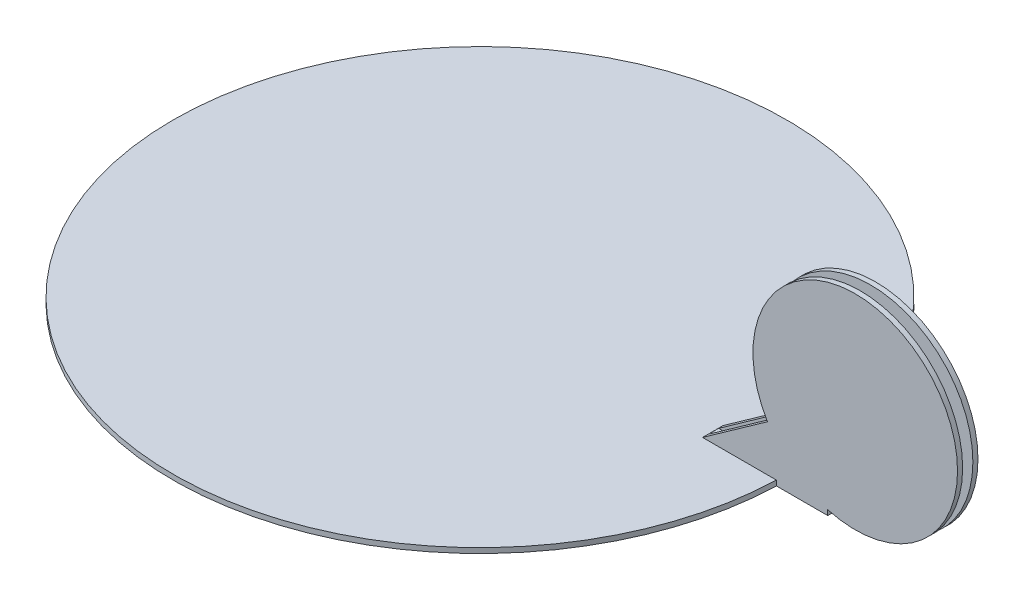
ISO-10303-21;
HEADER;
FILE_DESCRIPTION(('STEP AP214'),'2;1');
FILE_NAME('part.step','',(''),(''),'','','');
FILE_SCHEMA(('AUTOMOTIVE_DESIGN { 1 0 10303 214 1 1 1 1 }'));
ENDSEC;
DATA;
#1=APPLICATION_CONTEXT('core data for automotive mechanical design processes');
#2=APPLICATION_PROTOCOL_DEFINITION('international standard','automotive_design',2000,#1);
#3=PRODUCT_CONTEXT('',#1,'mechanical');
#4=PRODUCT('Part','Part','',(#3));
#5=PRODUCT_RELATED_PRODUCT_CATEGORY('part','',(#4));
#6=PRODUCT_DEFINITION_FORMATION('','',#4);
#7=PRODUCT_DEFINITION_CONTEXT('part definition',#1,'design');
#8=PRODUCT_DEFINITION('design','',#6,#7);
#9=PRODUCT_DEFINITION_SHAPE('','',#8);
#10=(LENGTH_UNIT() NAMED_UNIT(*) SI_UNIT(.MILLI.,.METRE.));
#11=(NAMED_UNIT(*) PLANE_ANGLE_UNIT() SI_UNIT($,.RADIAN.));
#12=(NAMED_UNIT(*) SI_UNIT($,.STERADIAN.) SOLID_ANGLE_UNIT());
#13=UNCERTAINTY_MEASURE_WITH_UNIT(LENGTH_MEASURE(1.E-05),#10,'distance_accuracy_value','');
#14=(GEOMETRIC_REPRESENTATION_CONTEXT(3) GLOBAL_UNCERTAINTY_ASSIGNED_CONTEXT((#13)) GLOBAL_UNIT_ASSIGNED_CONTEXT((#10,
#11,#12)) REPRESENTATION_CONTEXT('',''));
#15=CARTESIAN_POINT('',(0.,0.,0.));
#16=DIRECTION('',(0.,0.,1.));
#17=DIRECTION('',(1.,0.,0.));
#18=AXIS2_PLACEMENT_3D('',#15,#16,#17);
#19=CARTESIAN_POINT('',(95.7307074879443,25.7342889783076,-2.54));
#20=DIRECTION('',(0.,0.,1.));
#21=DIRECTION('',(1.,0.,0.));
#22=AXIS2_PLACEMENT_3D('',#19,#20,#21);
#23=CYLINDRICAL_SURFACE('',#22,25.4);
#24=DIRECTION('',(0.,0.,1.));
#25=VECTOR('',#24,1.);
#26=CARTESIAN_POINT('',(73.9300811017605,12.7,-2.54));
#27=LINE('',#26,#25);
#28=CARTESIAN_POINT('',(73.9300811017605,12.7,-2.54));
#29=VERTEX_POINT('',#28);
#30=CARTESIAN_POINT('',(73.9300811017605,12.7,-1.26999999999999));
#31=VERTEX_POINT('',#30);
#32=EDGE_CURVE('E187',#29,#31,#27,.T.);
#33=ORIENTED_EDGE('',*,*,#32,.T.);
#34=CARTESIAN_POINT('',(95.7307074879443,25.7342889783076,-1.27));
#35=DIRECTION('',(0.,0.,1.));
#36=DIRECTION('',(1.,0.,0.));
#37=AXIS2_PLACEMENT_3D('',#34,#35,#36);
#38=CIRCLE('',#37,25.4);
#39=CARTESIAN_POINT('',(88.9,1.27000000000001,-1.27));
#40=VERTEX_POINT('',#39);
#41=EDGE_CURVE('E152',#40,#31,#38,.T.);
#42=ORIENTED_EDGE('',*,*,#41,.F.);
#43=DIRECTION('',(0.,0.,1.));
#44=VECTOR('',#43,1.);
#45=CARTESIAN_POINT('',(88.9,1.27000000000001,-2.54));
#46=LINE('',#45,#44);
#47=CARTESIAN_POINT('',(88.9,1.27000000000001,-2.54));
#48=VERTEX_POINT('',#47);
#49=EDGE_CURVE('E183',#48,#40,#46,.T.);
#50=ORIENTED_EDGE('',*,*,#49,.F.);
#51=CARTESIAN_POINT('',(95.7307074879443,25.7342889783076,-2.54));
#52=DIRECTION('',(0.,0.,-1.));
#53=DIRECTION('',(-1.,0.,0.));
#54=AXIS2_PLACEMENT_3D('',#51,#52,#53);
#55=CIRCLE('',#54,25.4);
#56=EDGE_CURVE('E169',#29,#48,#55,.T.);
#57=ORIENTED_EDGE('',*,*,#56,.F.);
#58=EDGE_LOOP('',(#33,#42,#50,#57));
#59=FACE_BOUND('',#58,.T.);
#60=ADVANCED_FACE('F32',(#59),#23,.T.);
#61=CARTESIAN_POINT('',(0.,0.,0.));
#62=DIRECTION('',(0.,1.,0.));
#63=DIRECTION('',(0.,0.,1.));
#64=AXIS2_PLACEMENT_3D('',#61,#62,#63);
#65=PLANE('',#64);
#66=DIRECTION('',(-1.,0.,0.));
#67=VECTOR('',#66,1.);
#68=CARTESIAN_POINT('',(125.702464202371,0.,-1.27));
#69=LINE('',#68,#67);
#70=CARTESIAN_POINT('',(88.9,0.,-1.27));
#71=VERTEX_POINT('',#70);
#72=CARTESIAN_POINT('',(76.93459056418,0.,-1.26999999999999));
#73=VERTEX_POINT('',#72);
#74=EDGE_CURVE('E229',#71,#73,#69,.T.);
#75=ORIENTED_EDGE('',*,*,#74,.T.);
#76=DIRECTION('',(0.,0.,1.));
#77=VECTOR('',#76,1.);
#78=CARTESIAN_POINT('',(76.93459056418,0.,-1.26999999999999));
#79=LINE('',#78,#77);
#80=CARTESIAN_POINT('',(76.93459056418,0.,1.27000000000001));
#81=VERTEX_POINT('',#80);
#82=EDGE_CURVE('E147',#73,#81,#79,.T.);
#83=ORIENTED_EDGE('',*,*,#82,.T.);
#84=DIRECTION('',(1.,0.,0.));
#85=VECTOR('',#84,1.);
#86=CARTESIAN_POINT('',(125.702464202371,0.,1.27));
#87=LINE('',#86,#85);
#88=CARTESIAN_POINT('',(88.9,0.,1.27));
#89=VERTEX_POINT('',#88);
#90=EDGE_CURVE('E143',#81,#89,#87,.T.);
#91=ORIENTED_EDGE('',*,*,#90,.T.);
#92=DIRECTION('',(0.,0.,1.));
#93=VECTOR('',#92,1.);
#94=CARTESIAN_POINT('',(88.9,0.,-2.54));
#95=LINE('',#94,#93);
#96=CARTESIAN_POINT('',(88.9,0.,2.54));
#97=VERTEX_POINT('',#96);
#98=EDGE_CURVE('E178',#89,#97,#95,.T.);
#99=ORIENTED_EDGE('',*,*,#98,.T.);
#100=DIRECTION('',(1.,0.,0.));
#101=VECTOR('',#100,1.);
#102=CARTESIAN_POINT('',(76.2,0.,2.54));
#103=LINE('',#102,#101);
#104=CARTESIAN_POINT('',(76.1576549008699,0.,2.54));
#105=VERTEX_POINT('',#104);
#106=EDGE_CURVE('E161',#105,#97,#103,.T.);
#107=ORIENTED_EDGE('',*,*,#106,.F.);
#108=CARTESIAN_POINT('',(0.,0.,0.));
#109=DIRECTION('',(0.,1.,0.));
#110=DIRECTION('',(0.,0.,1.));
#111=AXIS2_PLACEMENT_3D('',#108,#109,#110);
#112=CIRCLE('',#111,76.2);
#113=CARTESIAN_POINT('',(76.1576549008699,0.,-2.54));
#114=VERTEX_POINT('',#113);
#115=EDGE_CURVE('E197',#114,#105,#112,.T.);
#116=ORIENTED_EDGE('',*,*,#115,.F.);
#117=DIRECTION('',(1.,0.,0.));
#118=VECTOR('',#117,1.);
#119=CARTESIAN_POINT('',(76.2,0.,-2.54));
#120=LINE('',#119,#118);
#121=CARTESIAN_POINT('',(88.9,0.,-2.54));
#122=VERTEX_POINT('',#121);
#123=EDGE_CURVE('E174',#114,#122,#120,.T.);
#124=ORIENTED_EDGE('',*,*,#123,.T.);
#125=EDGE_CURVE('E179',#122,#71,#95,.T.);
#126=ORIENTED_EDGE('',*,*,#125,.T.);
#127=EDGE_LOOP('',(#75,#83,#91,#99,#107,#116,#124,#126));
#128=FACE_BOUND('',#127,.T.);
#129=ADVANCED_FACE('F227',(#128),#65,.F.);
#130=CARTESIAN_POINT('',(95.7307074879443,25.7342889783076,1.27));
#131=DIRECTION('',(0.,0.,-1.));
#132=DIRECTION('',(-1.,0.,0.));
#133=AXIS2_PLACEMENT_3D('',#130,#131,#132);
#134=CIRCLE('',#133,25.4);
#135=CARTESIAN_POINT('',(73.9300811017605,12.7,1.26999999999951));
#136=VERTEX_POINT('',#135);
#137=CARTESIAN_POINT('',(88.9,1.27000000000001,1.27));
#138=VERTEX_POINT('',#137);
#139=EDGE_CURVE('E47',#136,#138,#134,.T.);
#140=ORIENTED_EDGE('',*,*,#139,.F.);
#141=CARTESIAN_POINT('',(73.9300811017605,12.7,2.54));
#142=VERTEX_POINT('',#141);
#143=EDGE_CURVE('E186',#136,#142,#27,.T.);
#144=ORIENTED_EDGE('',*,*,#143,.T.);
#145=CARTESIAN_POINT('',(95.7307074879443,25.7342889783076,2.54));
#146=DIRECTION('',(0.,0.,-1.));
#147=DIRECTION('',(-1.,0.,0.));
#148=AXIS2_PLACEMENT_3D('',#145,#146,#147);
#149=CIRCLE('',#148,25.4);
#150=CARTESIAN_POINT('',(88.9,1.27000000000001,2.54));
#151=VERTEX_POINT('',#150);
#152=EDGE_CURVE('E155',#142,#151,#149,.T.);
#153=ORIENTED_EDGE('',*,*,#152,.T.);
#154=EDGE_CURVE('E182',#138,#151,#46,.T.);
#155=ORIENTED_EDGE('',*,*,#154,.F.);
#156=EDGE_LOOP('',(#140,#144,#153,#155));
#157=FACE_BOUND('',#156,.T.);
#158=ADVANCED_FACE('F208',(#157),#23,.T.);
#159=CARTESIAN_POINT('',(88.9,0.,-2.54));
#160=DIRECTION('',(1.,0.,0.));
#161=DIRECTION('',(0.,0.,-1.));
#162=AXIS2_PLACEMENT_3D('',#159,#160,#161);
#163=PLANE('',#162);
#164=ORIENTED_EDGE('',*,*,#49,.T.);
#165=DIRECTION('',(0.,-1.,0.));
#166=VECTOR('',#165,1.);
#167=CARTESIAN_POINT('',(88.9,0.,-1.27));
#168=LINE('',#167,#166);
#169=EDGE_CURVE('E11',#40,#71,#168,.T.);
#170=ORIENTED_EDGE('',*,*,#169,.T.);
#171=ORIENTED_EDGE('',*,*,#125,.F.);
#172=DIRECTION('',(0.,1.,0.));
#173=VECTOR('',#172,1.);
#174=CARTESIAN_POINT('',(88.9,0.,-2.54));
#175=LINE('',#174,#173);
#176=EDGE_CURVE('E171',#122,#48,#175,.T.);
#177=ORIENTED_EDGE('',*,*,#176,.T.);
#178=EDGE_LOOP('',(#164,#170,#171,#177));
#179=FACE_BOUND('',#178,.T.);
#180=ADVANCED_FACE('F247',(#179),#163,.T.);
#181=ORIENTED_EDGE('',*,*,#98,.F.);
#182=DIRECTION('',(0.,1.,0.));
#183=VECTOR('',#182,1.);
#184=CARTESIAN_POINT('',(88.9,0.,1.27));
#185=LINE('',#184,#183);
#186=EDGE_CURVE('E40',#89,#138,#185,.T.);
#187=ORIENTED_EDGE('',*,*,#186,.T.);
#188=ORIENTED_EDGE('',*,*,#154,.T.);
#189=DIRECTION('',(0.,1.,0.));
#190=VECTOR('',#189,1.);
#191=CARTESIAN_POINT('',(88.9,0.,2.54));
#192=LINE('',#191,#190);
#193=EDGE_CURVE('E158',#97,#151,#192,.T.);
#194=ORIENTED_EDGE('',*,*,#193,.F.);
#195=EDGE_LOOP('',(#181,#187,#188,#194));
#196=FACE_BOUND('',#195,.T.);
#197=ADVANCED_FACE('F205',(#196),#163,.T.);
#198=CARTESIAN_POINT('',(0.,1.27,0.));
#199=DIRECTION('',(0.,-1.,0.));
#200=DIRECTION('',(0.,0.,-1.));
#201=AXIS2_PLACEMENT_3D('',#198,#199,#200);
#202=CYLINDRICAL_SURFACE('',#201,76.2);
#203=CARTESIAN_POINT('',(0.,1.27,0.));
#204=DIRECTION('',(0.,1.,0.));
#205=DIRECTION('',(0.,0.,1.));
#206=AXIS2_PLACEMENT_3D('',#203,#204,#205);
#207=CIRCLE('',#206,76.2);
#208=CARTESIAN_POINT('',(76.1576549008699,1.27,-2.54));
#209=VERTEX_POINT('',#208);
#210=CARTESIAN_POINT('',(76.1576549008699,1.27,2.54));
#211=VERTEX_POINT('',#210);
#212=EDGE_CURVE('E198',#209,#211,#207,.T.);
#213=ORIENTED_EDGE('',*,*,#212,.F.);
#214=DIRECTION('',(0.,-1.,0.));
#215=VECTOR('',#214,1.);
#216=CARTESIAN_POINT('',(76.1576549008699,1.27,-2.54));
#217=LINE('',#216,#215);
#218=EDGE_CURVE('E194',#209,#114,#217,.T.);
#219=ORIENTED_EDGE('',*,*,#218,.T.);
#220=ORIENTED_EDGE('',*,*,#115,.T.);
#221=DIRECTION('',(0.,-1.,0.));
#222=VECTOR('',#221,1.);
#223=CARTESIAN_POINT('',(76.1576549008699,1.27,2.54));
#224=LINE('',#223,#222);
#225=EDGE_CURVE('E190',#211,#105,#224,.T.);
#226=ORIENTED_EDGE('',*,*,#225,.F.);
#227=EDGE_LOOP('',(#213,#219,#220,#226));
#228=FACE_BOUND('',#227,.T.);
#229=ADVANCED_FACE('F34',(#228),#202,.T.);
#230=CARTESIAN_POINT('',(0.,1.27,0.));
#231=DIRECTION('',(0.,1.,0.));
#232=DIRECTION('',(0.,0.,1.));
#233=AXIS2_PLACEMENT_3D('',#230,#231,#232);
#234=PLANE('',#233);
#235=DIRECTION('',(-1.,0.,0.));
#236=VECTOR('',#235,1.);
#237=CARTESIAN_POINT('',(0.,1.27,-2.54));
#238=LINE('',#237,#236);
#239=CARTESIAN_POINT('',(57.8101545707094,1.27,-2.54));
#240=VERTEX_POINT('',#239);
#241=EDGE_CURVE('E192',#209,#240,#238,.T.);
#242=ORIENTED_EDGE('',*,*,#241,.F.);
#243=ORIENTED_EDGE('',*,*,#212,.T.);
#244=DIRECTION('',(1.,0.,0.));
#245=VECTOR('',#244,1.);
#246=CARTESIAN_POINT('',(57.8101545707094,1.27,2.54));
#247=LINE('',#246,#245);
#248=CARTESIAN_POINT('',(57.8101545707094,1.27,2.54));
#249=VERTEX_POINT('',#248);
#250=EDGE_CURVE('E164',#249,#211,#247,.T.);
#251=ORIENTED_EDGE('',*,*,#250,.F.);
#252=DIRECTION('',(0.,0.,1.));
#253=VECTOR('',#252,1.);
#254=CARTESIAN_POINT('',(57.8101545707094,1.27,-2.54));
#255=LINE('',#254,#253);
#256=EDGE_CURVE('E176',#240,#249,#255,.T.);
#257=ORIENTED_EDGE('',*,*,#256,.F.);
#258=EDGE_LOOP('',(#242,#243,#251,#257));
#259=FACE_BOUND('',#258,.T.);
#260=ADVANCED_FACE('F219',(#259),#234,.T.);
#261=CARTESIAN_POINT('',(95.7307074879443,25.7342889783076,-2.54));
#262=DIRECTION('',(0.,0.,-1.));
#263=DIRECTION('',(-1.,0.,0.));
#264=AXIS2_PLACEMENT_3D('',#261,#262,#263);
#265=PLANE('',#264);
#266=ORIENTED_EDGE('',*,*,#218,.F.);
#267=ORIENTED_EDGE('',*,*,#241,.T.);
#268=DIRECTION('',(0.815744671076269,0.57841216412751,0.));
#269=VECTOR('',#268,1.);
#270=CARTESIAN_POINT('',(57.8101545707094,1.27,-2.54));
#271=LINE('',#270,#269);
#272=EDGE_CURVE('E166',#240,#29,#271,.T.);
#273=ORIENTED_EDGE('',*,*,#272,.T.);
#274=ORIENTED_EDGE('',*,*,#56,.T.);
#275=ORIENTED_EDGE('',*,*,#176,.F.);
#276=ORIENTED_EDGE('',*,*,#123,.F.);
#277=EDGE_LOOP('',(#266,#267,#273,#274,#275,#276));
#278=FACE_BOUND('',#277,.T.);
#279=ADVANCED_FACE('F245',(#278),#265,.T.);
#280=CARTESIAN_POINT('',(95.7307074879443,25.7342889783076,2.54));
#281=DIRECTION('',(0.,0.,-1.));
#282=DIRECTION('',(-1.,0.,0.));
#283=AXIS2_PLACEMENT_3D('',#280,#281,#282);
#284=PLANE('',#283);
#285=ORIENTED_EDGE('',*,*,#250,.T.);
#286=ORIENTED_EDGE('',*,*,#225,.T.);
#287=ORIENTED_EDGE('',*,*,#106,.T.);
#288=ORIENTED_EDGE('',*,*,#193,.T.);
#289=ORIENTED_EDGE('',*,*,#152,.F.);
#290=DIRECTION('',(0.815744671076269,0.57841216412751,0.));
#291=VECTOR('',#290,1.);
#292=CARTESIAN_POINT('',(57.8101545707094,1.27,2.54));
#293=LINE('',#292,#291);
#294=EDGE_CURVE('E55',#249,#142,#293,.T.);
#295=ORIENTED_EDGE('',*,*,#294,.F.);
#296=EDGE_LOOP('',(#285,#286,#287,#288,#289,#295));
#297=FACE_BOUND('',#296,.T.);
#298=ADVANCED_FACE('F210',(#297),#284,.F.);
#299=CARTESIAN_POINT('',(57.8101545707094,1.27,-2.54));
#300=DIRECTION('',(0.57841216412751,-0.815744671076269,0.));
#301=DIRECTION('',(0.815744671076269,0.57841216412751,0.));
#302=AXIS2_PLACEMENT_3D('',#299,#300,#301);
#303=PLANE('',#302);
#304=DIRECTION('',(0.,0.,-1.));
#305=VECTOR('',#304,1.);
#306=CARTESIAN_POINT('',(57.9946406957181,1.40081178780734,-2.54));
#307=LINE('',#306,#305);
#308=CARTESIAN_POINT('',(57.9946406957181,1.40081178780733,1.26999999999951));
#309=VERTEX_POINT('',#308);
#310=CARTESIAN_POINT('',(57.9946406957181,1.40081178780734,-1.26999999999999));
#311=VERTEX_POINT('',#310);
#312=EDGE_CURVE('E129',#309,#311,#307,.T.);
#313=ORIENTED_EDGE('',*,*,#312,.T.);
#314=DIRECTION('',(0.815744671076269,0.57841216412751,0.));
#315=VECTOR('',#314,1.);
#316=CARTESIAN_POINT('',(57.8101545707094,1.27,-1.26999999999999));
#317=LINE('',#316,#315);
#318=EDGE_CURVE('E230',#311,#31,#317,.T.);
#319=ORIENTED_EDGE('',*,*,#318,.T.);
#320=ORIENTED_EDGE('',*,*,#32,.F.);
#321=ORIENTED_EDGE('',*,*,#272,.F.);
#322=ORIENTED_EDGE('',*,*,#256,.T.);
#323=ORIENTED_EDGE('',*,*,#294,.T.);
#324=ORIENTED_EDGE('',*,*,#143,.F.);
#325=DIRECTION('',(-0.815744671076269,-0.57841216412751,0.));
#326=VECTOR('',#325,1.);
#327=CARTESIAN_POINT('',(57.8101545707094,1.27,1.26999999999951));
#328=LINE('',#327,#326);
#329=EDGE_CURVE('E236',#136,#309,#328,.T.);
#330=ORIENTED_EDGE('',*,*,#329,.T.);
#331=EDGE_LOOP('',(#313,#319,#320,#321,#322,#323,#324,#330));
#332=FACE_BOUND('',#331,.T.);
#333=ADVANCED_FACE('F212',(#332),#303,.F.);
#334=CARTESIAN_POINT('',(76.93459056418,152.4,-1.26999999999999));
#335=DIRECTION('',(1.,0.,0.));
#336=DIRECTION('',(0.,0.,-1.));
#337=AXIS2_PLACEMENT_3D('',#334,#335,#336);
#338=PLANE('',#337);
#339=DIRECTION('',(0.,0.,-1.));
#340=VECTOR('',#339,1.);
#341=CARTESIAN_POINT('',(76.93459056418,1.40081178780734,-1.26999999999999));
#342=LINE('',#341,#340);
#343=CARTESIAN_POINT('',(76.93459056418,1.40081178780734,1.26999999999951));
#344=VERTEX_POINT('',#343);
#345=CARTESIAN_POINT('',(76.93459056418,1.40081178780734,-1.26999999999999));
#346=VERTEX_POINT('',#345);
#347=EDGE_CURVE('E126',#344,#346,#342,.T.);
#348=ORIENTED_EDGE('',*,*,#347,.F.);
#349=DIRECTION('',(0.,-1.,0.));
#350=VECTOR('',#349,1.);
#351=CARTESIAN_POINT('',(76.93459056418,152.4,1.27000000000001));
#352=LINE('',#351,#350);
#353=EDGE_CURVE('E137',#344,#81,#352,.T.);
#354=ORIENTED_EDGE('',*,*,#353,.T.);
#355=ORIENTED_EDGE('',*,*,#82,.F.);
#356=DIRECTION('',(0.,-1.,0.));
#357=VECTOR('',#356,1.);
#358=CARTESIAN_POINT('',(76.93459056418,152.4,-1.26999999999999));
#359=LINE('',#358,#357);
#360=EDGE_CURVE('E139',#346,#73,#359,.T.);
#361=ORIENTED_EDGE('',*,*,#360,.F.);
#362=EDGE_LOOP('',(#348,#354,#355,#361));
#363=FACE_BOUND('',#362,.T.);
#364=ADVANCED_FACE('F135',(#363),#338,.T.);
#365=CARTESIAN_POINT('',(125.702464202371,152.4,-1.27));
#366=DIRECTION('',(0.,0.,1.));
#367=DIRECTION('',(1.,0.,0.));
#368=AXIS2_PLACEMENT_3D('',#365,#366,#367);
#369=PLANE('',#368);
#370=ORIENTED_EDGE('',*,*,#41,.T.);
#371=ORIENTED_EDGE('',*,*,#318,.F.);
#372=DIRECTION('',(1.,0.,0.));
#373=VECTOR('',#372,1.);
#374=CARTESIAN_POINT('',(-75.46540943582,1.40081178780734,-1.26999999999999));
#375=LINE('',#374,#373);
#376=EDGE_CURVE('E132',#311,#346,#375,.T.);
#377=ORIENTED_EDGE('',*,*,#376,.T.);
#378=ORIENTED_EDGE('',*,*,#360,.T.);
#379=ORIENTED_EDGE('',*,*,#74,.F.);
#380=ORIENTED_EDGE('',*,*,#169,.F.);
#381=EDGE_LOOP('',(#370,#371,#377,#378,#379,#380));
#382=FACE_BOUND('',#381,.T.);
#383=ADVANCED_FACE('F239',(#382),#369,.T.);
#384=CARTESIAN_POINT('',(125.702464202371,152.4,1.27));
#385=DIRECTION('',(0.,0.,-1.));
#386=DIRECTION('',(-1.,0.,0.));
#387=AXIS2_PLACEMENT_3D('',#384,#385,#386);
#388=PLANE('',#387);
#389=ORIENTED_EDGE('',*,*,#139,.T.);
#390=ORIENTED_EDGE('',*,*,#186,.F.);
#391=ORIENTED_EDGE('',*,*,#90,.F.);
#392=ORIENTED_EDGE('',*,*,#353,.F.);
#393=DIRECTION('',(1.,0.,0.));
#394=VECTOR('',#393,1.);
#395=CARTESIAN_POINT('',(-75.46540943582,1.40081178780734,1.26999999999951));
#396=LINE('',#395,#394);
#397=EDGE_CURVE('E122',#309,#344,#396,.T.);
#398=ORIENTED_EDGE('',*,*,#397,.F.);
#399=ORIENTED_EDGE('',*,*,#329,.F.);
#400=EDGE_LOOP('',(#389,#390,#391,#392,#398,#399));
#401=FACE_BOUND('',#400,.T.);
#402=ADVANCED_FACE('F141',(#401),#388,.T.);
#403=CARTESIAN_POINT('',(-75.46540943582,1.40081178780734,-1.26999999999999));
#404=DIRECTION('',(0.,-1.,0.));
#405=DIRECTION('',(0.,0.,-1.));
#406=AXIS2_PLACEMENT_3D('',#403,#404,#405);
#407=PLANE('',#406);
#408=ORIENTED_EDGE('',*,*,#397,.T.);
#409=ORIENTED_EDGE('',*,*,#347,.T.);
#410=ORIENTED_EDGE('',*,*,#376,.F.);
#411=ORIENTED_EDGE('',*,*,#312,.F.);
#412=EDGE_LOOP('',(#408,#409,#410,#411));
#413=FACE_BOUND('',#412,.T.);
#414=ADVANCED_FACE('F124',(#413),#407,.F.);
#415=CLOSED_SHELL('',(#60,#129,#158,#180,#197,#229,#260,#279,#298,#333,#364,#383,#402,#414));
#416=MANIFOLD_SOLID_BREP('B2',#415);
#417=ADVANCED_BREP_SHAPE_REPRESENTATION('',(#18,#416),#14);
#418=SHAPE_DEFINITION_REPRESENTATION(#9,#417);
ENDSEC;
END-ISO-10303-21;
